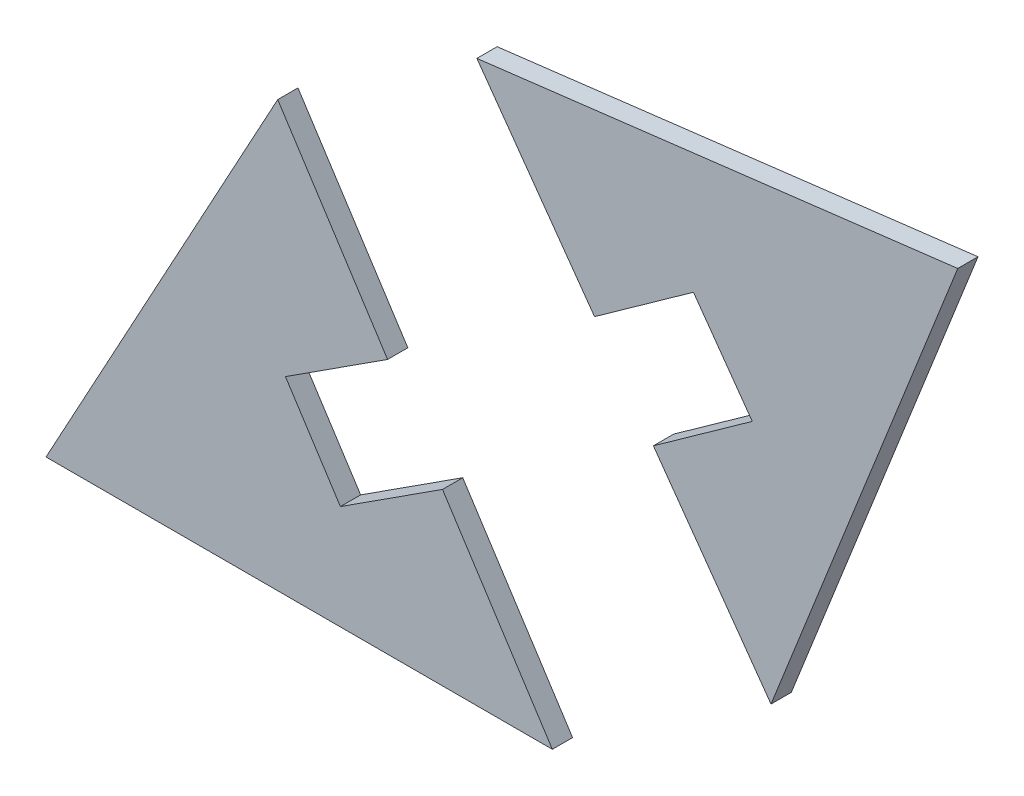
ISO-10303-21;
HEADER;
FILE_DESCRIPTION(('STEP AP214'),'2;1');
FILE_NAME('part.step','',(''),(''),'','','');
FILE_SCHEMA(('AUTOMOTIVE_DESIGN { 1 0 10303 214 1 1 1 1 }'));
ENDSEC;
DATA;
#1=APPLICATION_CONTEXT('core data for automotive mechanical design processes');
#2=APPLICATION_PROTOCOL_DEFINITION('international standard','automotive_design',2000,#1);
#3=PRODUCT_CONTEXT('',#1,'mechanical');
#4=PRODUCT('Part','Part','',(#3));
#5=PRODUCT_RELATED_PRODUCT_CATEGORY('part','',(#4));
#6=PRODUCT_DEFINITION_FORMATION('','',#4);
#7=PRODUCT_DEFINITION_CONTEXT('part definition',#1,'design');
#8=PRODUCT_DEFINITION('design','',#6,#7);
#9=PRODUCT_DEFINITION_SHAPE('','',#8);
#10=(LENGTH_UNIT() NAMED_UNIT(*) SI_UNIT(.MILLI.,.METRE.));
#11=(NAMED_UNIT(*) PLANE_ANGLE_UNIT() SI_UNIT($,.RADIAN.));
#12=(NAMED_UNIT(*) SI_UNIT($,.STERADIAN.) SOLID_ANGLE_UNIT());
#13=UNCERTAINTY_MEASURE_WITH_UNIT(LENGTH_MEASURE(1.E-05),#10,'distance_accuracy_value','');
#14=(GEOMETRIC_REPRESENTATION_CONTEXT(3) GLOBAL_UNCERTAINTY_ASSIGNED_CONTEXT((#13)) GLOBAL_UNIT_ASSIGNED_CONTEXT((#10,
#11,#12)) REPRESENTATION_CONTEXT('',''));
#15=CARTESIAN_POINT('',(0.,0.,0.));
#16=DIRECTION('',(0.,0.,1.));
#17=DIRECTION('',(1.,0.,0.));
#18=AXIS2_PLACEMENT_3D('',#15,#16,#17);
#19=CARTESIAN_POINT('',(14.9888335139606,30.0680478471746,2.));
#20=DIRECTION('',(-0.580924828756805,0.813957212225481,0.));
#21=DIRECTION('',(-0.813957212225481,-0.580924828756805,0.));
#22=AXIS2_PLACEMENT_3D('',#19,#20,#21);
#23=PLANE('',#22);
#24=DIRECTION('',(0.813957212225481,0.580924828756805,0.));
#25=VECTOR('',#24,1.);
#26=CARTESIAN_POINT('',(14.9888335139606,30.0680478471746,0.));
#27=LINE('',#26,#25);
#28=CARTESIAN_POINT('',(14.9888335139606,30.0680478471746,0.));
#29=VERTEX_POINT('',#28);
#30=CARTESIAN_POINT('',(24.7563200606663,37.0391457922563,0.));
#31=VERTEX_POINT('',#30);
#32=EDGE_CURVE('E133',#29,#31,#27,.T.);
#33=ORIENTED_EDGE('',*,*,#32,.T.);
#34=DIRECTION('',(0.,0.,-1.));
#35=VECTOR('',#34,1.);
#36=CARTESIAN_POINT('',(24.7563200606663,37.0391457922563,2.));
#37=LINE('',#36,#35);
#38=CARTESIAN_POINT('',(24.7563200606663,37.0391457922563,2.));
#39=VERTEX_POINT('',#38);
#40=EDGE_CURVE('E12',#39,#31,#37,.T.);
#41=ORIENTED_EDGE('',*,*,#40,.F.);
#42=DIRECTION('',(0.813957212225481,0.580924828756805,0.));
#43=VECTOR('',#42,1.);
#44=CARTESIAN_POINT('',(14.9888335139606,30.0680478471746,2.));
#45=LINE('',#44,#43);
#46=CARTESIAN_POINT('',(14.9888335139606,30.0680478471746,2.));
#47=VERTEX_POINT('',#46);
#48=EDGE_CURVE('E145',#47,#39,#45,.T.);
#49=ORIENTED_EDGE('',*,*,#48,.F.);
#50=DIRECTION('',(0.,0.,-1.));
#51=VECTOR('',#50,1.);
#52=CARTESIAN_POINT('',(14.9888335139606,30.0680478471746,2.));
#53=LINE('',#52,#51);
#54=EDGE_CURVE('E129',#47,#29,#53,.T.);
#55=ORIENTED_EDGE('',*,*,#54,.T.);
#56=EDGE_LOOP('',(#33,#41,#49,#55));
#57=FACE_BOUND('',#56,.T.);
#58=ADVANCED_FACE('F43',(#57),#23,.F.);
#59=CARTESIAN_POINT('',(24.7563200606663,37.0391457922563,2.));
#60=DIRECTION('',(0.813957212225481,0.580924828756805,0.));
#61=DIRECTION('',(-0.580924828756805,0.813957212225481,0.));
#62=AXIS2_PLACEMENT_3D('',#59,#60,#61);
#63=PLANE('',#62);
#64=DIRECTION('',(0.580924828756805,-0.813957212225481,0.));
#65=VECTOR('',#64,1.);
#66=CARTESIAN_POINT('',(24.7563200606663,37.0391457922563,0.));
#67=LINE('',#66,#65);
#68=CARTESIAN_POINT('',(30.5655683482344,28.8995736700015,0.));
#69=VERTEX_POINT('',#68);
#70=EDGE_CURVE('E136',#31,#69,#67,.T.);
#71=ORIENTED_EDGE('',*,*,#70,.T.);
#72=DIRECTION('',(0.,0.,-1.));
#73=VECTOR('',#72,1.);
#74=CARTESIAN_POINT('',(30.5655683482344,28.8995736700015,2.));
#75=LINE('',#74,#73);
#76=CARTESIAN_POINT('',(30.5655683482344,28.8995736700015,2.));
#77=VERTEX_POINT('',#76);
#78=EDGE_CURVE('E51',#77,#69,#75,.T.);
#79=ORIENTED_EDGE('',*,*,#78,.F.);
#80=DIRECTION('',(0.580924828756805,-0.813957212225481,0.));
#81=VECTOR('',#80,1.);
#82=CARTESIAN_POINT('',(24.7563200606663,37.0391457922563,2.));
#83=LINE('',#82,#81);
#84=EDGE_CURVE('E99',#39,#77,#83,.T.);
#85=ORIENTED_EDGE('',*,*,#84,.F.);
#86=ORIENTED_EDGE('',*,*,#40,.T.);
#87=EDGE_LOOP('',(#71,#79,#85,#86));
#88=FACE_BOUND('',#87,.T.);
#89=ADVANCED_FACE('F170',(#88),#63,.F.);
#90=CARTESIAN_POINT('',(30.5655683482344,28.8995736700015,2.));
#91=DIRECTION('',(0.580924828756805,-0.813957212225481,0.));
#92=DIRECTION('',(0.813957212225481,0.580924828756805,0.));
#93=AXIS2_PLACEMENT_3D('',#90,#91,#92);
#94=PLANE('',#93);
#95=DIRECTION('',(-0.813957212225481,-0.580924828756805,0.));
#96=VECTOR('',#95,1.);
#97=CARTESIAN_POINT('',(30.5655683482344,28.8995736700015,0.));
#98=LINE('',#97,#96);
#99=CARTESIAN_POINT('',(20.7980818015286,21.9284757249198,0.));
#100=VERTEX_POINT('',#99);
#101=EDGE_CURVE('E138',#69,#100,#98,.T.);
#102=ORIENTED_EDGE('',*,*,#101,.T.);
#103=DIRECTION('',(0.,0.,-1.));
#104=VECTOR('',#103,1.);
#105=CARTESIAN_POINT('',(20.7980818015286,21.9284757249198,2.));
#106=LINE('',#105,#104);
#107=CARTESIAN_POINT('',(20.7980818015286,21.9284757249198,2.));
#108=VERTEX_POINT('',#107);
#109=EDGE_CURVE('E149',#108,#100,#106,.T.);
#110=ORIENTED_EDGE('',*,*,#109,.F.);
#111=DIRECTION('',(-0.813957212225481,-0.580924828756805,0.));
#112=VECTOR('',#111,1.);
#113=CARTESIAN_POINT('',(30.5655683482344,28.8995736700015,2.));
#114=LINE('',#113,#112);
#115=EDGE_CURVE('E157',#77,#108,#114,.T.);
#116=ORIENTED_EDGE('',*,*,#115,.F.);
#117=ORIENTED_EDGE('',*,*,#78,.T.);
#118=EDGE_LOOP('',(#102,#110,#116,#117));
#119=FACE_BOUND('',#118,.T.);
#120=ADVANCED_FACE('F155',(#119),#94,.F.);
#121=CARTESIAN_POINT('',(32.4165783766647,5.64933148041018,2.));
#122=DIRECTION('',(0.813957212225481,0.580924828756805,0.));
#123=DIRECTION('',(-0.580924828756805,0.813957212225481,0.));
#124=AXIS2_PLACEMENT_3D('',#121,#122,#123);
#125=PLANE('',#124);
#126=DIRECTION('',(0.580924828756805,-0.813957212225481,0.));
#127=VECTOR('',#126,1.);
#128=CARTESIAN_POINT('',(32.4165783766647,5.64933148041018,0.));
#129=LINE('',#128,#127);
#130=CARTESIAN_POINT('',(32.4165783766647,5.64933148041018,0.));
#131=VERTEX_POINT('',#130);
#132=EDGE_CURVE('E140',#100,#131,#129,.T.);
#133=ORIENTED_EDGE('',*,*,#132,.T.);
#134=DIRECTION('',(0.,0.,-1.));
#135=VECTOR('',#134,1.);
#136=CARTESIAN_POINT('',(32.4165783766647,5.64933148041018,2.));
#137=LINE('',#136,#135);
#138=CARTESIAN_POINT('',(32.4165783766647,5.64933148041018,2.));
#139=VERTEX_POINT('',#138);
#140=EDGE_CURVE('E124',#139,#131,#137,.T.);
#141=ORIENTED_EDGE('',*,*,#140,.F.);
#142=DIRECTION('',(0.580924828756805,-0.813957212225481,0.));
#143=VECTOR('',#142,1.);
#144=CARTESIAN_POINT('',(32.4165783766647,5.64933148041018,2.));
#145=LINE('',#144,#143);
#146=EDGE_CURVE('E115',#108,#139,#145,.T.);
#147=ORIENTED_EDGE('',*,*,#146,.F.);
#148=ORIENTED_EDGE('',*,*,#109,.T.);
#149=EDGE_LOOP('',(#133,#141,#147,#148));
#150=FACE_BOUND('',#149,.T.);
#151=ADVANCED_FACE('F163',(#150),#125,.F.);
#152=CARTESIAN_POINT('',(50.8552637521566,52.1252917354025,2.));
#153=DIRECTION('',(-0.929519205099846,0.368773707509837,0.));
#154=DIRECTION('',(-0.368773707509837,-0.929519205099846,0.));
#155=AXIS2_PLACEMENT_3D('',#152,#153,#154);
#156=PLANE('',#155);
#157=DIRECTION('',(0.368773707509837,0.929519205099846,0.));
#158=VECTOR('',#157,1.);
#159=CARTESIAN_POINT('',(50.8552637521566,52.1252917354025,0.));
#160=LINE('',#159,#158);
#161=CARTESIAN_POINT('',(50.8552637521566,52.1252917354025,0.));
#162=VERTEX_POINT('',#161);
#163=EDGE_CURVE('E123',#131,#162,#160,.T.);
#164=ORIENTED_EDGE('',*,*,#163,.T.);
#165=DIRECTION('',(0.,0.,-1.));
#166=VECTOR('',#165,1.);
#167=CARTESIAN_POINT('',(50.8552637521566,52.1252917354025,2.));
#168=LINE('',#167,#166);
#169=CARTESIAN_POINT('',(50.8552637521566,52.1252917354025,2.));
#170=VERTEX_POINT('',#169);
#171=EDGE_CURVE('E120',#170,#162,#168,.T.);
#172=ORIENTED_EDGE('',*,*,#171,.F.);
#173=DIRECTION('',(0.368773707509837,0.929519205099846,0.));
#174=VECTOR('',#173,1.);
#175=CARTESIAN_POINT('',(50.8552637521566,52.1252917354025,2.));
#176=LINE('',#175,#174);
#177=EDGE_CURVE('E109',#139,#170,#176,.T.);
#178=ORIENTED_EDGE('',*,*,#177,.F.);
#179=ORIENTED_EDGE('',*,*,#140,.T.);
#180=EDGE_LOOP('',(#164,#172,#178,#179));
#181=FACE_BOUND('',#180,.T.);
#182=ADVANCED_FACE('F121',(#181),#156,.F.);
#183=CARTESIAN_POINT('',(3.37033693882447,46.3471920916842,2.));
#184=DIRECTION('',(0.12079183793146,-0.992677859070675,0.));
#185=DIRECTION('',(0.992677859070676,0.12079183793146,0.));
#186=AXIS2_PLACEMENT_3D('',#183,#184,#185);
#187=PLANE('',#186);
#188=DIRECTION('',(-0.992677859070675,-0.12079183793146,0.));
#189=VECTOR('',#188,1.);
#190=CARTESIAN_POINT('',(3.37033693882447,46.3471920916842,0.));
#191=LINE('',#190,#189);
#192=CARTESIAN_POINT('',(3.37033693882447,46.3471920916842,0.));
#193=VERTEX_POINT('',#192);
#194=EDGE_CURVE('E85',#162,#193,#191,.T.);
#195=ORIENTED_EDGE('',*,*,#194,.T.);
#196=DIRECTION('',(0.,0.,-1.));
#197=VECTOR('',#196,1.);
#198=CARTESIAN_POINT('',(3.37033693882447,46.3471920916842,2.));
#199=LINE('',#198,#197);
#200=CARTESIAN_POINT('',(3.37033693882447,46.3471920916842,2.));
#201=VERTEX_POINT('',#200);
#202=EDGE_CURVE('E125',#201,#193,#199,.T.);
#203=ORIENTED_EDGE('',*,*,#202,.F.);
#204=DIRECTION('',(-0.992677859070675,-0.12079183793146,0.));
#205=VECTOR('',#204,1.);
#206=CARTESIAN_POINT('',(3.37033693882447,46.3471920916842,2.));
#207=LINE('',#206,#205);
#208=EDGE_CURVE('E113',#170,#201,#207,.T.);
#209=ORIENTED_EDGE('',*,*,#208,.F.);
#210=ORIENTED_EDGE('',*,*,#171,.T.);
#211=EDGE_LOOP('',(#195,#203,#209,#210));
#212=FACE_BOUND('',#211,.T.);
#213=ADVANCED_FACE('F127',(#212),#187,.F.);
#214=CARTESIAN_POINT('',(14.9888335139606,30.0680478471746,2.));
#215=DIRECTION('',(0.813957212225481,0.580924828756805,0.));
#216=DIRECTION('',(-0.580924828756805,0.813957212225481,0.));
#217=AXIS2_PLACEMENT_3D('',#214,#215,#216);
#218=PLANE('',#217);
#219=DIRECTION('',(0.580924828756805,-0.813957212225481,0.));
#220=VECTOR('',#219,1.);
#221=CARTESIAN_POINT('',(14.9888335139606,30.0680478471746,0.));
#222=LINE('',#221,#220);
#223=EDGE_CURVE('E91',#193,#29,#222,.T.);
#224=ORIENTED_EDGE('',*,*,#223,.T.);
#225=ORIENTED_EDGE('',*,*,#54,.F.);
#226=DIRECTION('',(0.580924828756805,-0.813957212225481,0.));
#227=VECTOR('',#226,1.);
#228=CARTESIAN_POINT('',(14.9888335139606,30.0680478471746,2.));
#229=LINE('',#228,#227);
#230=EDGE_CURVE('E59',#201,#47,#229,.T.);
#231=ORIENTED_EDGE('',*,*,#230,.F.);
#232=ORIENTED_EDGE('',*,*,#202,.T.);
#233=EDGE_LOOP('',(#224,#225,#231,#232));
#234=FACE_BOUND('',#233,.T.);
#235=ADVANCED_FACE('F184',(#234),#218,.F.);
#236=CARTESIAN_POINT('',(0.,0.,2.));
#237=DIRECTION('',(0.,0.,-1.));
#238=DIRECTION('',(-1.,0.,0.));
#239=AXIS2_PLACEMENT_3D('',#236,#237,#238);
#240=PLANE('',#239);
#241=ORIENTED_EDGE('',*,*,#48,.T.);
#242=ORIENTED_EDGE('',*,*,#84,.T.);
#243=ORIENTED_EDGE('',*,*,#115,.T.);
#244=ORIENTED_EDGE('',*,*,#146,.T.);
#245=ORIENTED_EDGE('',*,*,#177,.T.);
#246=ORIENTED_EDGE('',*,*,#208,.T.);
#247=ORIENTED_EDGE('',*,*,#230,.T.);
#248=EDGE_LOOP('',(#241,#242,#243,#244,#245,#246,#247));
#249=FACE_BOUND('',#248,.T.);
#250=ADVANCED_FACE('F111',(#249),#240,.F.);
#251=CARTESIAN_POINT('',(0.,0.,0.));
#252=DIRECTION('',(0.,0.,-1.));
#253=DIRECTION('',(-1.,0.,0.));
#254=AXIS2_PLACEMENT_3D('',#251,#252,#253);
#255=PLANE('',#254);
#256=ORIENTED_EDGE('',*,*,#32,.F.);
#257=ORIENTED_EDGE('',*,*,#223,.F.);
#258=ORIENTED_EDGE('',*,*,#194,.F.);
#259=ORIENTED_EDGE('',*,*,#163,.F.);
#260=ORIENTED_EDGE('',*,*,#132,.F.);
#261=ORIENTED_EDGE('',*,*,#101,.F.);
#262=ORIENTED_EDGE('',*,*,#70,.F.);
#263=EDGE_LOOP('',(#256,#257,#258,#259,#260,#261,#262));
#264=FACE_BOUND('',#263,.T.);
#265=ADVANCED_FACE('F161',(#264),#255,.T.);
#266=CLOSED_SHELL('',(#58,#89,#120,#151,#182,#213,#235,#250,#265));
#267=MANIFOLD_SOLID_BREP('B2',#266);
#268=CARTESIAN_POINT('',(-5.45009684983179,16.1881945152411,2.));
#269=DIRECTION('',(-0.840146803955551,-0.542359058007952,0.));
#270=DIRECTION('',(0.542359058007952,-0.840146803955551,0.));
#271=AXIS2_PLACEMENT_3D('',#268,#269,#270);
#272=PLANE('',#271);
#273=DIRECTION('',(-0.542359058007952,0.840146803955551,0.));
#274=VECTOR('',#273,1.);
#275=CARTESIAN_POINT('',(-5.45009684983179,16.1881945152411,0.));
#276=LINE('',#275,#274);
#277=CARTESIAN_POINT('',(-5.45009684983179,16.1881945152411,0.));
#278=VERTEX_POINT('',#277);
#279=CARTESIAN_POINT('',(-16.2972780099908,32.9911305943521,0.));
#280=VERTEX_POINT('',#279);
#281=EDGE_CURVE('E335',#278,#280,#276,.T.);
#282=ORIENTED_EDGE('',*,*,#281,.T.);
#283=DIRECTION('',(0.,0.,-1.));
#284=VECTOR('',#283,1.);
#285=CARTESIAN_POINT('',(-16.2972780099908,32.9911305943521,2.));
#286=LINE('',#285,#284);
#287=CARTESIAN_POINT('',(-16.2972780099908,32.9911305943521,2.));
#288=VERTEX_POINT('',#287);
#289=EDGE_CURVE('E41',#288,#280,#286,.T.);
#290=ORIENTED_EDGE('',*,*,#289,.F.);
#291=DIRECTION('',(-0.542359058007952,0.840146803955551,0.));
#292=VECTOR('',#291,1.);
#293=CARTESIAN_POINT('',(-5.45009684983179,16.1881945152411,2.));
#294=LINE('',#293,#292);
#295=CARTESIAN_POINT('',(-5.45009684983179,16.1881945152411,2.));
#296=VERTEX_POINT('',#295);
#297=EDGE_CURVE('E347',#296,#288,#294,.T.);
#298=ORIENTED_EDGE('',*,*,#297,.F.);
#299=DIRECTION('',(0.,0.,-1.));
#300=VECTOR('',#299,1.);
#301=CARTESIAN_POINT('',(-5.45009684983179,16.1881945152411,2.));
#302=LINE('',#301,#300);
#303=EDGE_CURVE('E331',#296,#278,#302,.T.);
#304=ORIENTED_EDGE('',*,*,#303,.T.);
#305=EDGE_LOOP('',(#282,#290,#298,#304));
#306=FACE_BOUND('',#305,.T.);
#307=ADVANCED_FACE('F245',(#306),#272,.F.);
#308=CARTESIAN_POINT('',(-16.2972780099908,32.9911305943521,2.));
#309=DIRECTION('',(0.878168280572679,-0.478351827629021,0.));
#310=DIRECTION('',(0.478351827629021,0.878168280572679,0.));
#311=AXIS2_PLACEMENT_3D('',#308,#309,#310);
#312=PLANE('',#311);
#313=DIRECTION('',(-0.478351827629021,-0.878168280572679,0.));
#314=VECTOR('',#313,1.);
#315=CARTESIAN_POINT('',(-16.2972780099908,32.9911305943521,0.));
#316=LINE('',#315,#314);
#317=CARTESIAN_POINT('',(-39.1793251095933,-9.01620960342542,0.));
#318=VERTEX_POINT('',#317);
#319=EDGE_CURVE('E338',#280,#318,#316,.T.);
#320=ORIENTED_EDGE('',*,*,#319,.T.);
#321=DIRECTION('',(0.,0.,-1.));
#322=VECTOR('',#321,1.);
#323=CARTESIAN_POINT('',(-39.1793251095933,-9.01620960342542,2.));
#324=LINE('',#323,#322);
#325=CARTESIAN_POINT('',(-39.1793251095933,-9.01620960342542,2.));
#326=VERTEX_POINT('',#325);
#327=EDGE_CURVE('E253',#326,#318,#324,.T.);
#328=ORIENTED_EDGE('',*,*,#327,.F.);
#329=DIRECTION('',(-0.478351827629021,-0.878168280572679,0.));
#330=VECTOR('',#329,1.);
#331=CARTESIAN_POINT('',(-16.2972780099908,32.9911305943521,2.));
#332=LINE('',#331,#330);
#333=EDGE_CURVE('E301',#288,#326,#332,.T.);
#334=ORIENTED_EDGE('',*,*,#333,.F.);
#335=ORIENTED_EDGE('',*,*,#289,.T.);
#336=EDGE_LOOP('',(#320,#328,#334,#335));
#337=FACE_BOUND('',#336,.T.);
#338=ADVANCED_FACE('F372',(#337),#312,.F.);
#339=CARTESIAN_POINT('',(-39.1793251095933,-9.01620960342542,2.));
#340=DIRECTION('',(0.,1.,0.));
#341=DIRECTION('',(0.,0.,1.));
#342=AXIS2_PLACEMENT_3D('',#339,#340,#341);
#343=PLANE('',#342);
#344=DIRECTION('',(1.,0.,0.));
#345=VECTOR('',#344,1.);
#346=CARTESIAN_POINT('',(-39.1793251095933,-9.01620960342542,0.));
#347=LINE('',#346,#345);
#348=CARTESIAN_POINT('',(10.8206748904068,-9.01620960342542,0.));
#349=VERTEX_POINT('',#348);
#350=EDGE_CURVE('E340',#318,#349,#347,.T.);
#351=ORIENTED_EDGE('',*,*,#350,.T.);
#352=DIRECTION('',(0.,0.,-1.));
#353=VECTOR('',#352,1.);
#354=CARTESIAN_POINT('',(10.8206748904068,-9.01620960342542,2.));
#355=LINE('',#354,#353);
#356=CARTESIAN_POINT('',(10.8206748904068,-9.01620960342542,2.));
#357=VERTEX_POINT('',#356);
#358=EDGE_CURVE('E351',#357,#349,#355,.T.);
#359=ORIENTED_EDGE('',*,*,#358,.F.);
#360=DIRECTION('',(1.,0.,0.));
#361=VECTOR('',#360,1.);
#362=CARTESIAN_POINT('',(-39.1793251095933,-9.01620960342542,2.));
#363=LINE('',#362,#361);
#364=EDGE_CURVE('E359',#326,#357,#363,.T.);
#365=ORIENTED_EDGE('',*,*,#364,.F.);
#366=ORIENTED_EDGE('',*,*,#327,.T.);
#367=EDGE_LOOP('',(#351,#359,#365,#366));
#368=FACE_BOUND('',#367,.T.);
#369=ADVANCED_FACE('F357',(#368),#343,.F.);
#370=CARTESIAN_POINT('',(10.8206748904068,-9.01620960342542,2.));
#371=DIRECTION('',(-0.840146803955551,-0.542359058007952,0.));
#372=DIRECTION('',(0.542359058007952,-0.840146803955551,0.));
#373=AXIS2_PLACEMENT_3D('',#370,#371,#372);
#374=PLANE('',#373);
#375=DIRECTION('',(-0.542359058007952,0.840146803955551,0.));
#376=VECTOR('',#375,1.);
#377=CARTESIAN_POINT('',(10.8206748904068,-9.01620960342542,0.));
#378=LINE('',#377,#376);
#379=CARTESIAN_POINT('',(-0.0265062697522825,7.7867264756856,0.));
#380=VERTEX_POINT('',#379);
#381=EDGE_CURVE('E342',#349,#380,#378,.T.);
#382=ORIENTED_EDGE('',*,*,#381,.T.);
#383=DIRECTION('',(0.,0.,-1.));
#384=VECTOR('',#383,1.);
#385=CARTESIAN_POINT('',(-0.0265062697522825,7.7867264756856,2.));
#386=LINE('',#385,#384);
#387=CARTESIAN_POINT('',(-0.0265062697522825,7.7867264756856,2.));
#388=VERTEX_POINT('',#387);
#389=EDGE_CURVE('E326',#388,#380,#386,.T.);
#390=ORIENTED_EDGE('',*,*,#389,.F.);
#391=DIRECTION('',(-0.542359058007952,0.840146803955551,0.));
#392=VECTOR('',#391,1.);
#393=CARTESIAN_POINT('',(10.8206748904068,-9.01620960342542,2.));
#394=LINE('',#393,#392);
#395=EDGE_CURVE('E317',#357,#388,#394,.T.);
#396=ORIENTED_EDGE('',*,*,#395,.F.);
#397=ORIENTED_EDGE('',*,*,#358,.T.);
#398=EDGE_LOOP('',(#382,#390,#396,#397));
#399=FACE_BOUND('',#398,.T.);
#400=ADVANCED_FACE('F365',(#399),#374,.F.);
#401=CARTESIAN_POINT('',(-10.1082679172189,1.27841777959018,2.));
#402=DIRECTION('',(0.542359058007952,-0.840146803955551,0.));
#403=DIRECTION('',(0.840146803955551,0.542359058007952,0.));
#404=AXIS2_PLACEMENT_3D('',#401,#402,#403);
#405=PLANE('',#404);
#406=DIRECTION('',(-0.840146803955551,-0.542359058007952,0.));
#407=VECTOR('',#406,1.);
#408=CARTESIAN_POINT('',(-10.1082679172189,1.27841777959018,0.));
#409=LINE('',#408,#407);
#410=CARTESIAN_POINT('',(-10.1082679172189,1.27841777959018,0.));
#411=VERTEX_POINT('',#410);
#412=EDGE_CURVE('E325',#380,#411,#409,.T.);
#413=ORIENTED_EDGE('',*,*,#412,.T.);
#414=DIRECTION('',(0.,0.,-1.));
#415=VECTOR('',#414,1.);
#416=CARTESIAN_POINT('',(-10.1082679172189,1.27841777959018,2.));
#417=LINE('',#416,#415);
#418=CARTESIAN_POINT('',(-10.1082679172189,1.27841777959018,2.));
#419=VERTEX_POINT('',#418);
#420=EDGE_CURVE('E322',#419,#411,#417,.T.);
#421=ORIENTED_EDGE('',*,*,#420,.F.);
#422=DIRECTION('',(-0.840146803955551,-0.542359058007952,0.));
#423=VECTOR('',#422,1.);
#424=CARTESIAN_POINT('',(-10.1082679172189,1.27841777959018,2.));
#425=LINE('',#424,#423);
#426=EDGE_CURVE('E311',#388,#419,#425,.T.);
#427=ORIENTED_EDGE('',*,*,#426,.F.);
#428=ORIENTED_EDGE('',*,*,#389,.T.);
#429=EDGE_LOOP('',(#413,#421,#427,#428));
#430=FACE_BOUND('',#429,.T.);
#431=ADVANCED_FACE('F323',(#430),#405,.F.);
#432=CARTESIAN_POINT('',(-15.5318584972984,9.67988581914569,2.));
#433=DIRECTION('',(-0.840146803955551,-0.542359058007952,0.));
#434=DIRECTION('',(0.542359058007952,-0.840146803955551,0.));
#435=AXIS2_PLACEMENT_3D('',#432,#433,#434);
#436=PLANE('',#435);
#437=DIRECTION('',(-0.542359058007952,0.840146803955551,0.));
#438=VECTOR('',#437,1.);
#439=CARTESIAN_POINT('',(-15.5318584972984,9.67988581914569,0.));
#440=LINE('',#439,#438);
#441=CARTESIAN_POINT('',(-15.5318584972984,9.67988581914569,0.));
#442=VERTEX_POINT('',#441);
#443=EDGE_CURVE('E287',#411,#442,#440,.T.);
#444=ORIENTED_EDGE('',*,*,#443,.T.);
#445=DIRECTION('',(0.,0.,-1.));
#446=VECTOR('',#445,1.);
#447=CARTESIAN_POINT('',(-15.5318584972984,9.67988581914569,2.));
#448=LINE('',#447,#446);
#449=CARTESIAN_POINT('',(-15.5318584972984,9.67988581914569,2.));
#450=VERTEX_POINT('',#449);
#451=EDGE_CURVE('E327',#450,#442,#448,.T.);
#452=ORIENTED_EDGE('',*,*,#451,.F.);
#453=DIRECTION('',(-0.542359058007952,0.840146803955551,0.));
#454=VECTOR('',#453,1.);
#455=CARTESIAN_POINT('',(-15.5318584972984,9.67988581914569,2.));
#456=LINE('',#455,#454);
#457=EDGE_CURVE('E315',#419,#450,#456,.T.);
#458=ORIENTED_EDGE('',*,*,#457,.F.);
#459=ORIENTED_EDGE('',*,*,#420,.T.);
#460=EDGE_LOOP('',(#444,#452,#458,#459));
#461=FACE_BOUND('',#460,.T.);
#462=ADVANCED_FACE('F329',(#461),#436,.F.);
#463=CARTESIAN_POINT('',(-5.45009684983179,16.1881945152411,2.));
#464=DIRECTION('',(-0.542359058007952,0.840146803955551,0.));
#465=DIRECTION('',(-0.840146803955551,-0.542359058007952,0.));
#466=AXIS2_PLACEMENT_3D('',#463,#464,#465);
#467=PLANE('',#466);
#468=DIRECTION('',(0.840146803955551,0.542359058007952,0.));
#469=VECTOR('',#468,1.);
#470=CARTESIAN_POINT('',(-5.45009684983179,16.1881945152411,0.));
#471=LINE('',#470,#469);
#472=EDGE_CURVE('E293',#442,#278,#471,.T.);
#473=ORIENTED_EDGE('',*,*,#472,.T.);
#474=ORIENTED_EDGE('',*,*,#303,.F.);
#475=DIRECTION('',(0.840146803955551,0.542359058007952,0.));
#476=VECTOR('',#475,1.);
#477=CARTESIAN_POINT('',(-5.45009684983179,16.1881945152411,2.));
#478=LINE('',#477,#476);
#479=EDGE_CURVE('E261',#450,#296,#478,.T.);
#480=ORIENTED_EDGE('',*,*,#479,.F.);
#481=ORIENTED_EDGE('',*,*,#451,.T.);
#482=EDGE_LOOP('',(#473,#474,#480,#481));
#483=FACE_BOUND('',#482,.T.);
#484=ADVANCED_FACE('F386',(#483),#467,.F.);
#485=CARTESIAN_POINT('',(0.,0.,2.));
#486=DIRECTION('',(0.,0.,-1.));
#487=DIRECTION('',(-1.,0.,0.));
#488=AXIS2_PLACEMENT_3D('',#485,#486,#487);
#489=PLANE('',#488);
#490=ORIENTED_EDGE('',*,*,#297,.T.);
#491=ORIENTED_EDGE('',*,*,#333,.T.);
#492=ORIENTED_EDGE('',*,*,#364,.T.);
#493=ORIENTED_EDGE('',*,*,#395,.T.);
#494=ORIENTED_EDGE('',*,*,#426,.T.);
#495=ORIENTED_EDGE('',*,*,#457,.T.);
#496=ORIENTED_EDGE('',*,*,#479,.T.);
#497=EDGE_LOOP('',(#490,#491,#492,#493,#494,#495,#496));
#498=FACE_BOUND('',#497,.T.);
#499=ADVANCED_FACE('F313',(#498),#489,.F.);
#500=CARTESIAN_POINT('',(0.,0.,0.));
#501=DIRECTION('',(0.,0.,-1.));
#502=DIRECTION('',(-1.,0.,0.));
#503=AXIS2_PLACEMENT_3D('',#500,#501,#502);
#504=PLANE('',#503);
#505=ORIENTED_EDGE('',*,*,#281,.F.);
#506=ORIENTED_EDGE('',*,*,#472,.F.);
#507=ORIENTED_EDGE('',*,*,#443,.F.);
#508=ORIENTED_EDGE('',*,*,#412,.F.);
#509=ORIENTED_EDGE('',*,*,#381,.F.);
#510=ORIENTED_EDGE('',*,*,#350,.F.);
#511=ORIENTED_EDGE('',*,*,#319,.F.);
#512=EDGE_LOOP('',(#505,#506,#507,#508,#509,#510,#511));
#513=FACE_BOUND('',#512,.T.);
#514=ADVANCED_FACE('F363',(#513),#504,.T.);
#515=CLOSED_SHELL('',(#307,#338,#369,#400,#431,#462,#484,#499,#514));
#516=MANIFOLD_SOLID_BREP('B6',#515);
#517=ADVANCED_BREP_SHAPE_REPRESENTATION('',(#18,#267,#516),#14);
#518=SHAPE_DEFINITION_REPRESENTATION(#9,#517);
ENDSEC;
END-ISO-10303-21;
